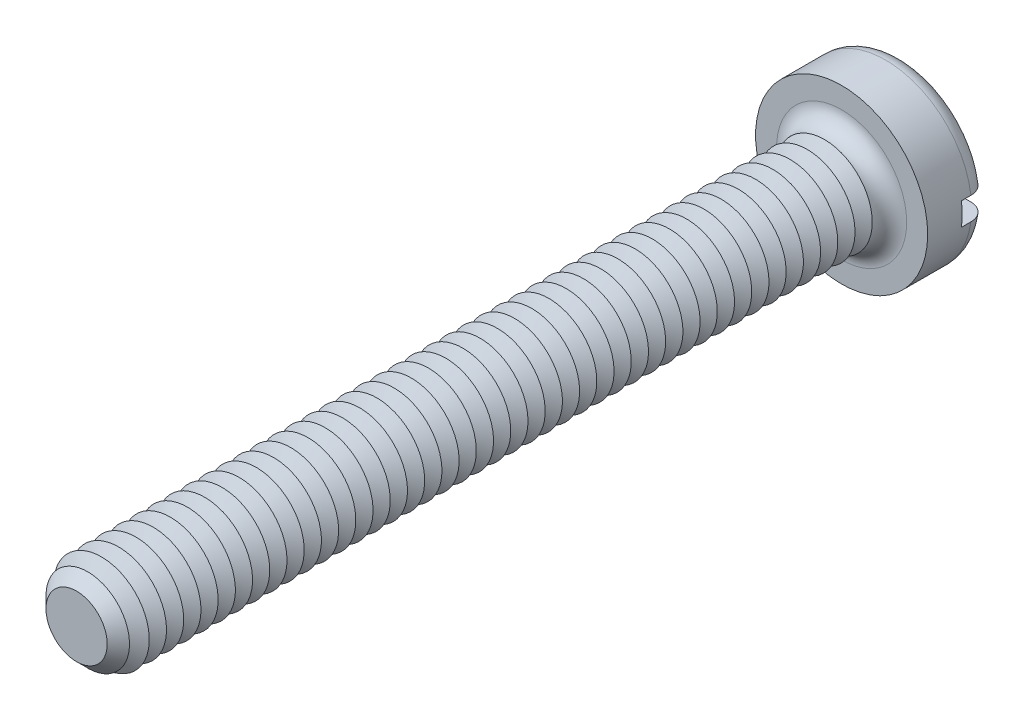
from build123d import *

# Parameters (mm, degrees)
SKETCH3_R           = 2.25
BOSS_EXTRUDE2_DEPTH = 1.6
SKETCH4_R           = 1.25
BOSS_EXTRUDE3_DEPTH = 20
FILLET1_R           = 0.45
CHAMFER1_SIZE       = 0.45
LPATTERN1_COUNT     = 43
LPATTERN1_PITCH     = 0.45
SKETCH8_W           = 4.5
SKETCH8_H           = 0.6
CUT_EXTRUDE1_DEPTH  = 0.7


with BuildPart() as part:
    # Sketch3 → Boss-Extrude2 (new body)
    with BuildSketch(Plane.XY):
        Circle(SKETCH3_R)
    extrude(amount=-BOSS_EXTRUDE2_DEPTH)

    # Sketch4 → Boss-Extrude3 (add)
    with BuildSketch(Plane.XY):
        Circle(SKETCH4_R)
    extrude(amount=BOSS_EXTRUDE3_DEPTH)

    # Fillet1
    fillet1_edges = [part.edges().sort_by_distance(p)[0] for p in [
        (-2.25, 0, -1.6),
        (-1.25, 0, 0),
    ]]
    fillet(fillet1_edges, radius=FILLET1_R)

    # Chamfer1
    chamfer1_edges = [part.edges().sort_by_distance(p)[0] for p in [
        (-1.25, 0, 20),
    ]]
    chamfer(chamfer1_edges, length=CHAMFER1_SIZE)

    # Sketch6 → Cut-Revolve1 (revolve, cut)
    with BuildSketch(Plane(origin=(0, 0, 0), x_dir=(0, 0, -1), z_dir=(1, 0, 0)), mode=Mode.PRIVATE) as cut_revolve1_sk:
        Polygon((-0.45, 1.25), (-0.675, 0.860288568), (-0.9, 1.25), align=None)
    cut_revolve1 = revolve(cut_revolve1_sk.sketch.rotate(Axis((0, 0, -1.694361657), (0, 0, 1)), 90), axis=Axis((0, 0, -1.694361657), (0, 0, 1)), mode=Mode.SUBTRACT)

    # LPattern1: Cut-Revolve1 ×43
    with Locations(*[(0, 0, i * LPATTERN1_PITCH) for i in range(1, LPATTERN1_COUNT)]):
        add(cut_revolve1, mode=Mode.SUBTRACT)

    # Sketch8 → Cut-Extrude1 (cut)
    with BuildSketch(Plane(origin=(0, 0, -1.6), x_dir=(-1, 0, 0), z_dir=(0, 0, -1))):
        Rectangle(SKETCH8_W, SKETCH8_H)
    extrude(amount=-CUT_EXTRUDE1_DEPTH, mode=Mode.SUBTRACT)


solid = part.part
